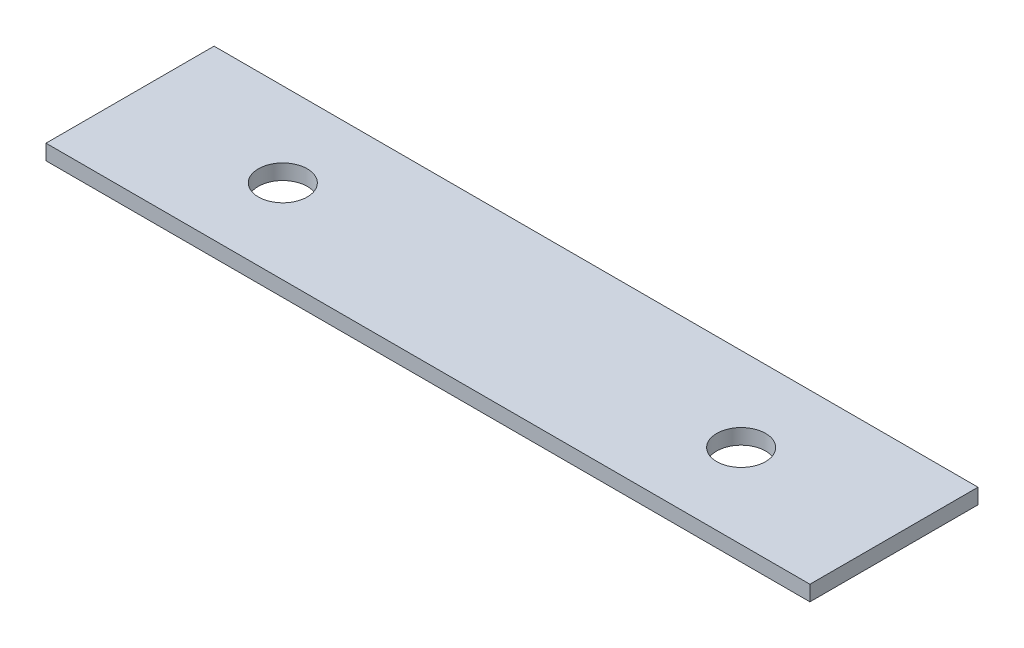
from build123d import *

# Parameters (mm, degrees)
SKETCH1_W      = 50
SKETCH1_H      = 11
SKETCH1_R      = 1.6
EXTRUDE1_DEPTH = 1


with BuildPart() as part:
    # Sketch1 → Extrude1 (new body)
    with BuildSketch(Plane(origin=(0, 0, 0), x_dir=(1, 0, 0), z_dir=(0, 1, 0))):
        with Locations((15, 0)):
            Rectangle(SKETCH1_W, SKETCH1_H)
        with Locations(Location((0, 0, 0), (0, 0, 270))):
            Circle(SKETCH1_R, mode=Mode.SUBTRACT)
        with Locations(Location((30, 0, 0), (0, 0, 270))):
            Circle(SKETCH1_R, mode=Mode.SUBTRACT)
    extrude(amount=EXTRUDE1_DEPTH)


solid = part.part
